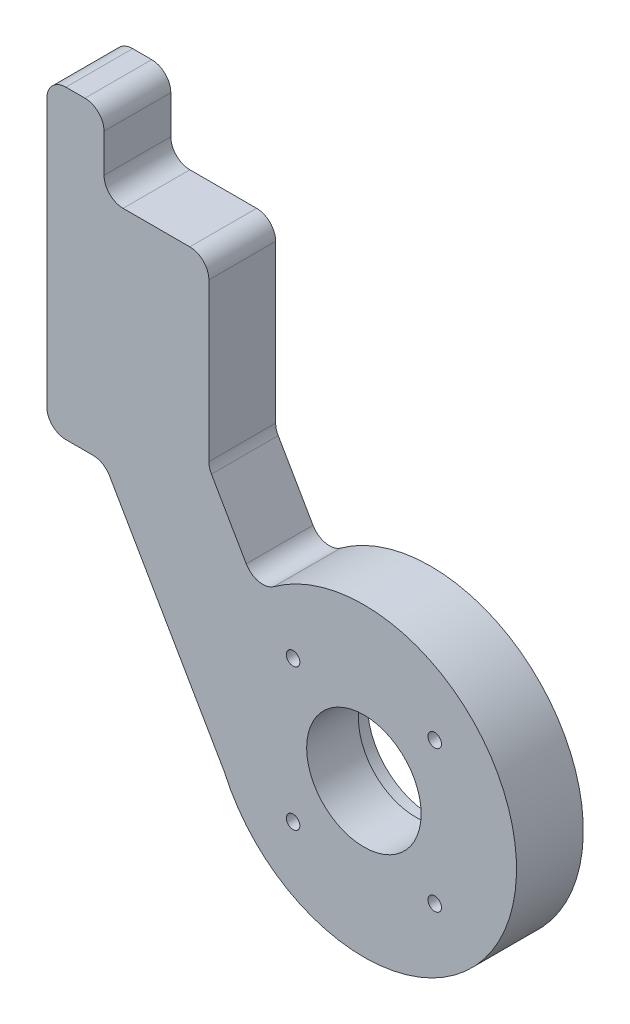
from build123d import *

# Parameters (mm, degrees)
SKETCH1_R           = 19.05
BOSS_EXTRUDE1_DEPTH = 22.225
CUT_EXTRUDE1_START  = -38.1
CUT_EXTRUDE1_DEPTH  = 38.1
SKETCH5_W           = 22.225
SKETCH5_H           = 101.6
BOSS_EXTRUDE2_DEPTH = 19.05
SKETCH6_R           = 4.6
CUT_EXTRUDE2_DEPTH  = 12.7
BOSS_EXTRUDE3_DEPTH = 22.225
SKETCH10_R          = 2.25
CUT_EXTRUDE3_DEPTH  = 51.054
FILLET1_R           = 6.35
SKETCH11_R          = 21
CUT_EXTRUDE4_DEPTH  = 5


with BuildPart() as part:
    # Sketch1 → Boss-Extrude1 (new body)
    with BuildSketch(Plane.XY):
        with BuildLine():
            Line((-37.251893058, 51.793849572), (-88.358653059, 140.313354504))
            ThreePointArc((-88.358653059, 140.313354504), (-94.928593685, 145.354647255), (-103.138975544, 144.273729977))
            Line((-103.138975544, 144.273729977), (-117.39384547, 136.043676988))
            ThreePointArc((-117.39384547, 136.043676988), (-122.435138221, 129.473736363), (-121.354220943, 121.263354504))
            Line((-121.354220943, 121.263354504), (-48.329220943, -5.219655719))
            ThreePointArc((-48.329220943, -5.219655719), (47.993054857, 5.648472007), (-37.251893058, 51.793849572))
        make_face()
        with Locations((-1.874420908, 15.337376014)):
            Circle(SKETCH1_R, mode=Mode.SUBTRACT)
    extrude(amount=BOSS_EXTRUDE1_DEPTH)

    # Sketch4 → Cut-Extrude1 (cut)
    with BuildSketch(Plane.XY.offset(22.225).offset(CUT_EXTRUDE1_START)):
        with BuildLine():
            Line((-88.358653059, 140.313354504), (-88.358653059, 64.113354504))
            Line((-88.358653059, 64.113354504), (-121.354220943, 121.263354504))
            ThreePointArc((-121.354220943, 121.263354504), (-122.435138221, 129.473736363), (-117.39384547, 136.043676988))
            Line((-117.39384547, 136.043676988), (-103.138975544, 144.273729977))
            ThreePointArc((-103.138975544, 144.273729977), (-94.928593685, 145.354647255), (-88.358653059, 140.313354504))
        make_face()
    extrude(amount=CUT_EXTRUDE1_DEPTH, mode=Mode.SUBTRACT)

    # Sketch5 → Boss-Extrude2 (add)
    with BuildSketch(Plane.ZY.offset(88.358653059)):
        with Locations((11.1125, 114.913354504)):
            Rectangle(SKETCH5_W, SKETCH5_H)
    extrude(amount=BOSS_EXTRUDE2_DEPTH)

    # Sketch6 → Cut-Extrude2 (cut)
    with BuildSketch(Plane.ZY.offset(107.408653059)):
        with Locations((11.1125, 153.013354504)):
            Circle(SKETCH6_R)
        with Locations((11.1125, 76.813354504)):
            Circle(SKETCH6_R)
    extrude(amount=-CUT_EXTRUDE2_DEPTH, mode=Mode.SUBTRACT)

    # Sketch9 → Boss-Extrude3 (add)
    with BuildSketch(Plane(origin=(0, 0, 0), x_dir=(-1, 0, 0), z_dir=(0, 0, -1))):
        Polygon((88.358653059, 140.313354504), (53.463846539, 140.313354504), (53.463846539, 79.873776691), align=None)
    extrude(amount=-BOSS_EXTRUDE3_DEPTH)

    # Sketch10 → Cut-Extrude3 (cut)
    with BuildSketch(Plane.XY.offset(22.225)):
        with Locations((-25.444420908, 38.907376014)):
            Circle(SKETCH10_R)
        with Locations((21.695579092, 38.907376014)):
            Circle(SKETCH10_R)
        with Locations((21.695579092, -8.232623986)):
            Circle(SKETCH10_R)
        with Locations((-25.444420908, -8.232623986)):
            Circle(SKETCH10_R)
    extrude(amount=-CUT_EXTRUDE3_DEPTH, mode=Mode.SUBTRACT)

    # Fillet1
    fillet1_edges = [part.edges().sort_by_distance(p)[0] for p in [
        (-48.329220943, -5.219655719, 11.1125),
        (-88.358653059, 140.313354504, 11.1125),
        (-37.251893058, 51.793849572, 11.1125),
        (-88.358653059, 64.113354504, 11.1125),
        (-88.358653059, 165.713354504, 11.1125),
        (-107.408653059, 64.113354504, 11.1125),
        (-107.408653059, 165.713354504, 11.1125),
        (-53.463846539, 79.873776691, 11.1125),
        (-53.463846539, 140.313354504, 11.1125),
    ]]
    fillet(fillet1_edges, radius=FILLET1_R)

    # Sketch11 → Cut-Extrude4 (cut)
    with BuildSketch(Plane(origin=(0, 0, 0), x_dir=(-1, 0, 0), z_dir=(0, 0, -1))):
        with Locations((1.874420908, 15.337376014)):
            Circle(SKETCH11_R)
    extrude(amount=-CUT_EXTRUDE4_DEPTH, mode=Mode.SUBTRACT)


solid = part.part
